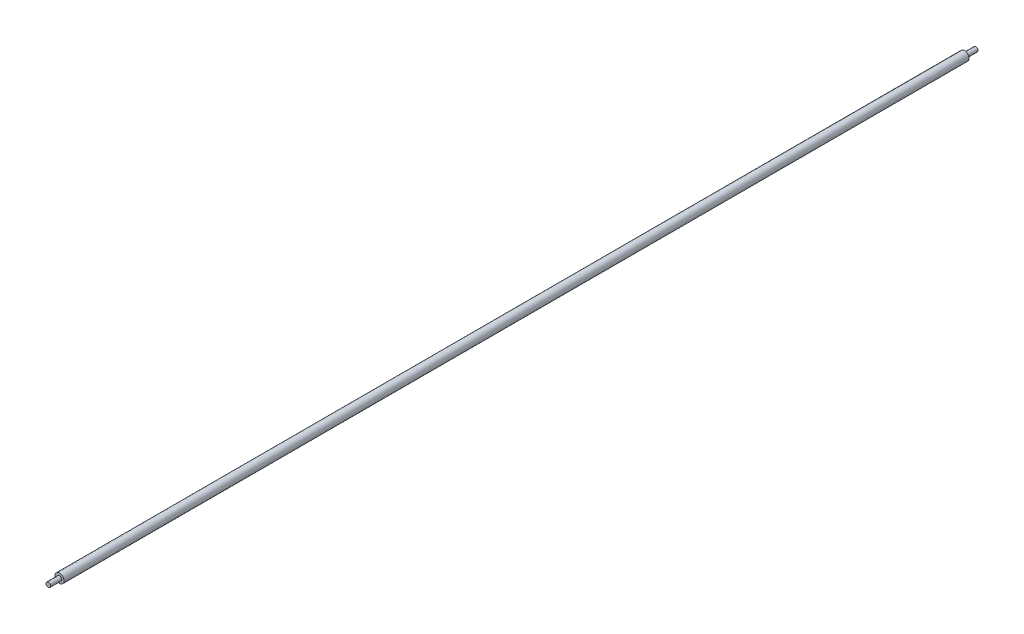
from build123d import *

# Parameters (mm, degrees)
SKETCH1_R           = 5.08
BOSS_EXTRUDE2_DEPTH = 1020
SKETCH2_R           = 2.54
BOSS_EXTRUDE3_DEPTH = 12.7
BOSS_EXTRUDE4_START = 12.7
SKETCH3_R           = 2.54
BOSS_EXTRUDE4_DEPTH = 12.7


with BuildPart() as part:
    # Sketch1 → Boss-Extrude2 (new body)
    with BuildSketch(Plane.XY):
        Circle(SKETCH1_R)
    extrude(amount=BOSS_EXTRUDE2_DEPTH)

    # Sketch2 → Boss-Extrude3 (add)
    with BuildSketch(Plane.XY.offset(1020)):
        Circle(SKETCH2_R)
    extrude(amount=BOSS_EXTRUDE3_DEPTH)

    # Sketch3 → Boss-Extrude4 (add)
    with BuildSketch(Plane(origin=(0, 0, 0), x_dir=(-1, 0, 0), z_dir=(0, 0, -1)).offset(BOSS_EXTRUDE4_START)):
        with Locations(Location((0, 0, 0), (0, 0, 180))):
            Circle(SKETCH3_R)
    extrude(amount=-BOSS_EXTRUDE4_DEPTH)


solid = part.part
